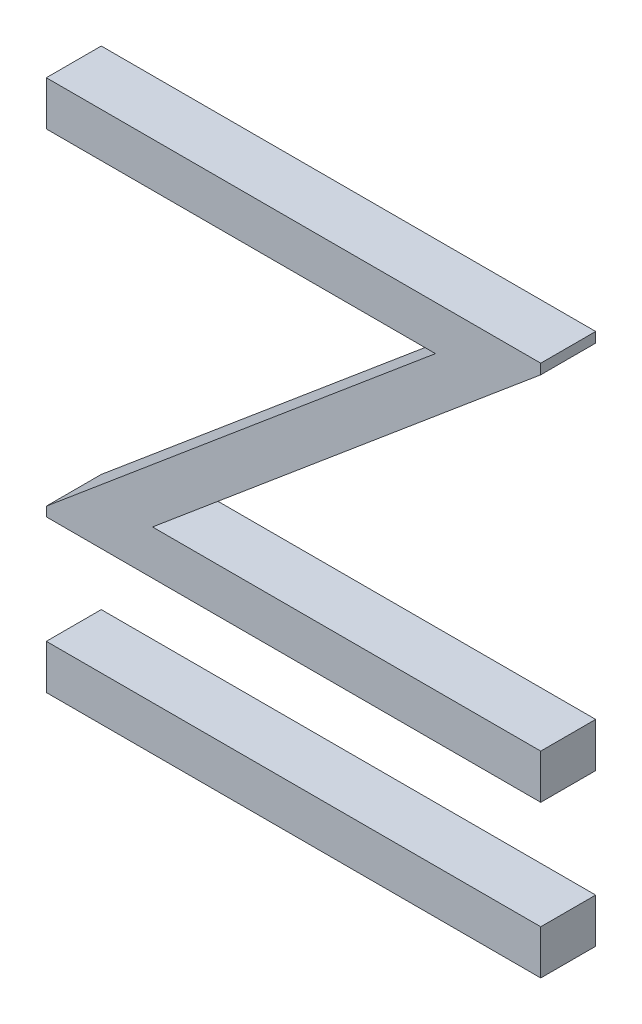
from build123d import *

# Parameters (mm, degrees)
SCHIZZO2_W                     = 90
SCHIZZO2_H                     = 8.076923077
ESTRUSIONE_ESTRUSIONE1_DEPTH   = 10
ESTRUSIONE_ESTRUSIONE1_2_DEPTH = 10


with BuildPart() as part:
    # Schizzo2 → Estrusione-Estrusione1 (new body)
    with BuildSketch(Plane.XY):
        with Locations((150, 15.576923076)):
            Rectangle(SCHIZZO2_W, SCHIZZO2_H)
    extrude(amount=ESTRUSIONE_ESTRUSIONE1_DEPTH)


with BuildPart() as body_2:
    # Schizzo2 → Estrusione-Estrusione1 2 (new body)
    with BuildSketch(Plane.XY):
        Polygon((195, 39.230769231), (105, 39.230769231), (105, 40.925480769), (175.835336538, 100.384615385), (105, 100.384615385), (105, 108.461538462), (195, 108.461538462), (195, 106.622596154), (124.326923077, 47.307692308), (195, 47.307692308), align=None)
    extrude(amount=ESTRUSIONE_ESTRUSIONE1_2_DEPTH)


solid = Compound([part.part, body_2.part])
